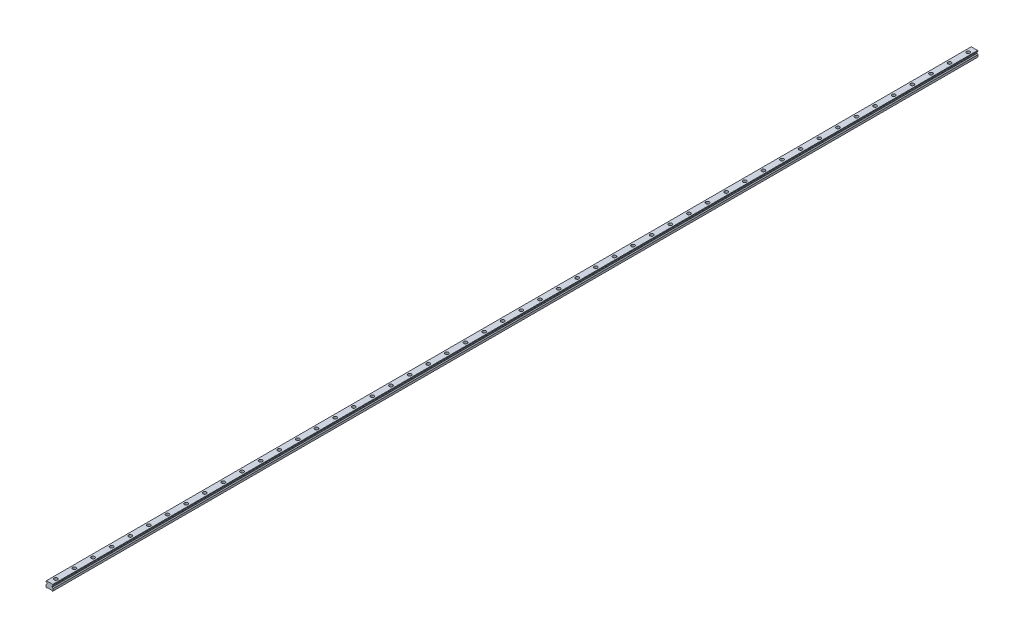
from build123d import *

# Parameters (mm, degrees)
SKETCH1_W           = 23
SKETCH1_H           = 19.2
BOSS_EXTRUDE1_DEPTH = 1490
CUT_EXTRUDE1_DEPTH  = 2981.084040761
CHAMFER1_SIZE       = 1.25
FILLET1_R           = 1.25
CUT_EXTRUDE2_DEPTH  = 2981.084040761
SKETCH4_R           = 5.5
SKETCH4_R_2         = 3.5
CUT_EXTRUDE3_DEPTH  = 9
SKETCH4_2_R         = 3.5
CUT_EXTRUDE4_DEPTH  = 1491.168074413
LPATTERN1_COUNT     = 50
LPATTERN1_PITCH     = 60


with BuildPart() as part:
    # Sketch1 → Boss-Extrude1 (new, symmetric)
    with BuildSketch(Plane.XY):
        with Locations((0, 9.6)):
            Rectangle(SKETCH1_W, SKETCH1_H)
    extrude(amount=BOSS_EXTRUDE1_DEPTH, both=True)

    # Sketch2 → Cut-Extrude1 (cut, through all)
    with BuildSketch(Plane.XY.offset(1490)):
        Polygon((-11.5, 16.7), (-11.5, 7.95), (-8.583333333, 10.866666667), (-8.583333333, 13.783333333), align=None)
        Polygon((8.583333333, 13.783333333), (11.5, 16.7), (11.5, 7.95), (8.583333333, 10.866666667), align=None)
    extrude(amount=-CUT_EXTRUDE1_DEPTH, mode=Mode.SUBTRACT)

    # Chamfer1
    chamfer1_edges = [part.edges().sort_by_distance(p)[0] for p in [
        (-11.5, 19.2, 0),
        (11.5, 19.2, 0),
        (11.5, 0, 0),
        (-11.5, 0, 0),
    ]]
    chamfer(chamfer1_edges, length=CHAMFER1_SIZE)

    # Fillet1
    fillet1_edges = [part.edges().sort_by_distance(p)[0] for p in [
        (-8.583333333, 13.783333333, 0),
        (-8.583333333, 10.866666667, 0),
        (8.583333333, 10.866666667, 0),
        (8.583333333, 13.783333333, 0),
    ]]
    fillet(fillet1_edges, radius=FILLET1_R)

    # Sketch3 → Cut-Extrude2 (cut, through all)
    with BuildSketch(Plane.XY.offset(1490)):
        Polygon((-7, 0), (-5.75, 1.25), (5.75, 1.25), (7, 0), align=None)
    extrude(amount=-CUT_EXTRUDE2_DEPTH, mode=Mode.SUBTRACT)

    # Sketch4 → Cut-Extrude3 (cut)
    with BuildSketch(Plane(origin=(0, 19.2, 0), x_dir=(1, 0, 0), z_dir=(0, 1, 0))):
        with Locations(Location((0, -1470, 0), (0, 0, 270))):
            Circle(SKETCH4_R)
        with Locations(Location((0, -1470, 0), (0, 0, 270))):
            Circle(SKETCH4_R_2, mode=Mode.SUBTRACT)
    cut_extrude3 = extrude(amount=-CUT_EXTRUDE3_DEPTH, mode=Mode.SUBTRACT)

    # Sketch4_2 → Cut-Extrude4 (cut, through all)
    with BuildSketch(Plane(origin=(0, 19.2, 0), x_dir=(1, 0, 0), z_dir=(0, 1, 0))):
        with Locations(Location((0, -1470, 0), (0, 0, 270))):
            Circle(SKETCH4_2_R)
    cut_extrude4 = extrude(amount=-CUT_EXTRUDE4_DEPTH, mode=Mode.SUBTRACT)

    # LPattern1: Cut-Extrude3, Cut-Extrude4 ×50
    with Locations(*[(0, 0, -i * LPATTERN1_PITCH) for i in range(1, LPATTERN1_COUNT)]):
        add(cut_extrude3, mode=Mode.SUBTRACT)
        add(cut_extrude4, mode=Mode.SUBTRACT)


solid = part.part
